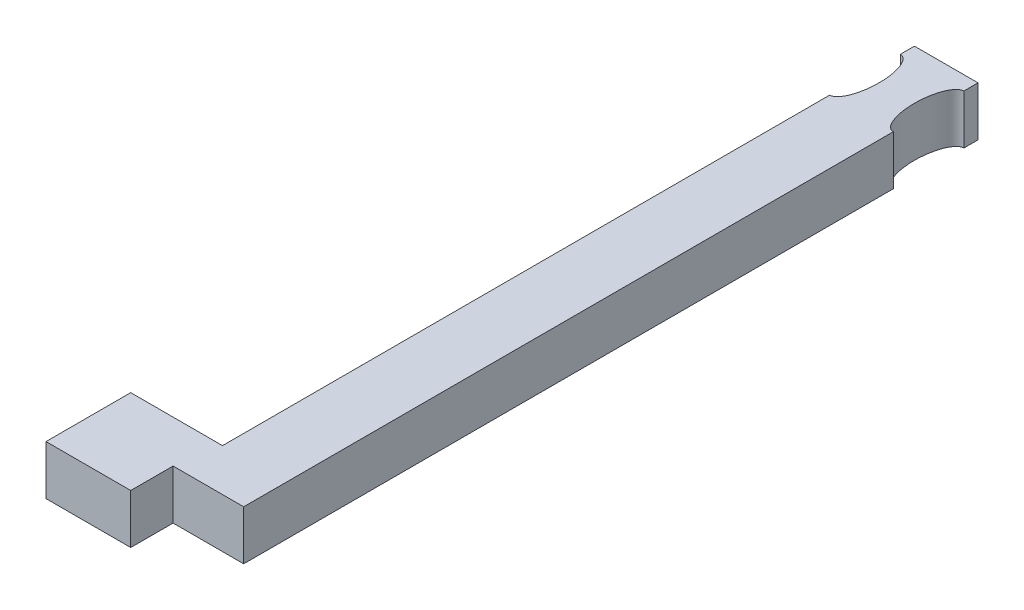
ISO-10303-21;
HEADER;
FILE_DESCRIPTION(('STEP AP214'),'2;1');
FILE_NAME('part.step','',(''),(''),'','','');
FILE_SCHEMA(('AUTOMOTIVE_DESIGN { 1 0 10303 214 1 1 1 1 }'));
ENDSEC;
DATA;
#1=APPLICATION_CONTEXT('core data for automotive mechanical design processes');
#2=APPLICATION_PROTOCOL_DEFINITION('international standard','automotive_design',2000,#1);
#3=PRODUCT_CONTEXT('',#1,'mechanical');
#4=PRODUCT('Part','Part','',(#3));
#5=PRODUCT_RELATED_PRODUCT_CATEGORY('part','',(#4));
#6=PRODUCT_DEFINITION_FORMATION('','',#4);
#7=PRODUCT_DEFINITION_CONTEXT('part definition',#1,'design');
#8=PRODUCT_DEFINITION('design','',#6,#7);
#9=PRODUCT_DEFINITION_SHAPE('','',#8);
#10=(LENGTH_UNIT() NAMED_UNIT(*) SI_UNIT(.MILLI.,.METRE.));
#11=(NAMED_UNIT(*) PLANE_ANGLE_UNIT() SI_UNIT($,.RADIAN.));
#12=(NAMED_UNIT(*) SI_UNIT($,.STERADIAN.) SOLID_ANGLE_UNIT());
#13=UNCERTAINTY_MEASURE_WITH_UNIT(LENGTH_MEASURE(1.E-05),#10,'distance_accuracy_value','');
#14=(GEOMETRIC_REPRESENTATION_CONTEXT(3) GLOBAL_UNCERTAINTY_ASSIGNED_CONTEXT((#13)) GLOBAL_UNIT_ASSIGNED_CONTEXT((#10,
#11,#12)) REPRESENTATION_CONTEXT('',''));
#15=CARTESIAN_POINT('',(0.,0.,0.));
#16=DIRECTION('',(0.,0.,1.));
#17=DIRECTION('',(1.,0.,0.));
#18=AXIS2_PLACEMENT_3D('',#15,#16,#17);
#19=CARTESIAN_POINT('',(6.5,3.5,-55.));
#20=DIRECTION('',(1.,0.,0.));
#21=DIRECTION('',(0.,0.,-1.));
#22=AXIS2_PLACEMENT_3D('',#19,#20,#21);
#23=PLANE('',#22);
#24=DIRECTION('',(0.,0.,1.));
#25=VECTOR('',#24,1.);
#26=CARTESIAN_POINT('',(6.5,0.,-55.));
#27=LINE('',#26,#25);
#28=CARTESIAN_POINT('',(6.5,0.,-55.));
#29=VERTEX_POINT('',#28);
#30=CARTESIAN_POINT('',(6.5,0.,-54.));
#31=VERTEX_POINT('',#30);
#32=EDGE_CURVE('E167',#29,#31,#27,.T.);
#33=ORIENTED_EDGE('',*,*,#32,.T.);
#34=DIRECTION('',(0.,-1.,0.));
#35=VECTOR('',#34,1.);
#36=CARTESIAN_POINT('',(6.5,3.5,-54.));
#37=LINE('',#36,#35);
#38=CARTESIAN_POINT('',(6.5,3.5,-54.));
#39=VERTEX_POINT('',#38);
#40=EDGE_CURVE('E11',#39,#31,#37,.T.);
#41=ORIENTED_EDGE('',*,*,#40,.F.);
#42=DIRECTION('',(0.,0.,1.));
#43=VECTOR('',#42,1.);
#44=CARTESIAN_POINT('',(6.5,3.5,-55.));
#45=LINE('',#44,#43);
#46=CARTESIAN_POINT('',(6.5,3.5,-55.));
#47=VERTEX_POINT('',#46);
#48=EDGE_CURVE('E191',#47,#39,#45,.T.);
#49=ORIENTED_EDGE('',*,*,#48,.F.);
#50=DIRECTION('',(0.,-1.,0.));
#51=VECTOR('',#50,1.);
#52=CARTESIAN_POINT('',(6.5,3.5,-55.));
#53=LINE('',#52,#51);
#54=EDGE_CURVE('E162',#47,#29,#53,.T.);
#55=ORIENTED_EDGE('',*,*,#54,.T.);
#56=EDGE_LOOP('',(#33,#41,#49,#55));
#57=FACE_BOUND('',#56,.T.);
#58=ADVANCED_FACE('F34',(#57),#23,.F.);
#59=CARTESIAN_POINT('',(6.5,3.5,-51.5));
#60=DIRECTION('',(0.,-1.,0.));
#61=DIRECTION('',(0.,0.,-1.));
#62=AXIS2_PLACEMENT_3D('',#59,#60,#61);
#63=ELLIPSE('',#62,2.5,1.);
#64=DIRECTION('',(0.,-1.,0.));
#65=VECTOR('',#64,1.);
#66=SURFACE_OF_LINEAR_EXTRUSION('',#63,#65);
#67=CARTESIAN_POINT('',(6.5,0.,-51.5));
#68=DIRECTION('',(0.,-1.,0.));
#69=DIRECTION('',(0.,0.,-1.));
#70=AXIS2_PLACEMENT_3D('',#67,#68,#69);
#71=ELLIPSE('',#70,2.5,1.);
#72=CARTESIAN_POINT('',(6.5,0.,-49.));
#73=VERTEX_POINT('',#72);
#74=EDGE_CURVE('E170',#31,#73,#71,.T.);
#75=ORIENTED_EDGE('',*,*,#74,.T.);
#76=DIRECTION('',(0.,-1.,0.));
#77=VECTOR('',#76,1.);
#78=CARTESIAN_POINT('',(6.5,3.5,-49.));
#79=LINE('',#78,#77);
#80=CARTESIAN_POINT('',(6.5,3.5,-49.));
#81=VERTEX_POINT('',#80);
#82=EDGE_CURVE('E41',#81,#73,#79,.T.);
#83=ORIENTED_EDGE('',*,*,#82,.F.);
#84=EDGE_CURVE('E110',#39,#81,#63,.T.);
#85=ORIENTED_EDGE('',*,*,#84,.F.);
#86=ORIENTED_EDGE('',*,*,#40,.T.);
#87=EDGE_LOOP('',(#75,#83,#85,#86));
#88=FACE_BOUND('',#87,.T.);
#89=ADVANCED_FACE('F265',(#88),#66,.F.);
#90=CARTESIAN_POINT('',(6.5,3.5,-49.));
#91=DIRECTION('',(1.,0.,0.));
#92=DIRECTION('',(0.,0.,-1.));
#93=AXIS2_PLACEMENT_3D('',#90,#91,#92);
#94=PLANE('',#93);
#95=DIRECTION('',(0.,0.,1.));
#96=VECTOR('',#95,1.);
#97=CARTESIAN_POINT('',(6.5,0.,-49.));
#98=LINE('',#97,#96);
#99=CARTESIAN_POINT('',(6.5,0.,-6.));
#100=VERTEX_POINT('',#99);
#101=EDGE_CURVE('E173',#73,#100,#98,.T.);
#102=ORIENTED_EDGE('',*,*,#101,.T.);
#103=DIRECTION('',(0.,-1.,0.));
#104=VECTOR('',#103,1.);
#105=CARTESIAN_POINT('',(6.5,3.5,-6.));
#106=LINE('',#105,#104);
#107=CARTESIAN_POINT('',(6.5,3.5,-6.));
#108=VERTEX_POINT('',#107);
#109=EDGE_CURVE('E210',#108,#100,#106,.T.);
#110=ORIENTED_EDGE('',*,*,#109,.F.);
#111=DIRECTION('',(0.,0.,1.));
#112=VECTOR('',#111,1.);
#113=CARTESIAN_POINT('',(6.5,3.5,-49.));
#114=LINE('',#113,#112);
#115=EDGE_CURVE('E218',#81,#108,#114,.T.);
#116=ORIENTED_EDGE('',*,*,#115,.F.);
#117=ORIENTED_EDGE('',*,*,#82,.T.);
#118=EDGE_LOOP('',(#102,#110,#116,#117));
#119=FACE_BOUND('',#118,.T.);
#120=ADVANCED_FACE('F216',(#119),#94,.F.);
#121=CARTESIAN_POINT('',(0.,3.5,-6.));
#122=DIRECTION('',(0.,0.,1.));
#123=DIRECTION('',(1.,0.,0.));
#124=AXIS2_PLACEMENT_3D('',#121,#122,#123);
#125=PLANE('',#124);
#126=DIRECTION('',(-1.,0.,0.));
#127=VECTOR('',#126,1.);
#128=CARTESIAN_POINT('',(0.,0.,-6.));
#129=LINE('',#128,#127);
#130=CARTESIAN_POINT('',(0.,0.,-6.));
#131=VERTEX_POINT('',#130);
#132=EDGE_CURVE('E175',#100,#131,#129,.T.);
#133=ORIENTED_EDGE('',*,*,#132,.T.);
#134=DIRECTION('',(0.,-1.,0.));
#135=VECTOR('',#134,1.);
#136=CARTESIAN_POINT('',(0.,3.5,-6.));
#137=LINE('',#136,#135);
#138=CARTESIAN_POINT('',(0.,3.5,-6.));
#139=VERTEX_POINT('',#138);
#140=EDGE_CURVE('E207',#139,#131,#137,.T.);
#141=ORIENTED_EDGE('',*,*,#140,.F.);
#142=DIRECTION('',(-1.,0.,0.));
#143=VECTOR('',#142,1.);
#144=CARTESIAN_POINT('',(0.,3.5,-6.));
#145=LINE('',#144,#143);
#146=EDGE_CURVE('E236',#108,#139,#145,.T.);
#147=ORIENTED_EDGE('',*,*,#146,.F.);
#148=ORIENTED_EDGE('',*,*,#109,.T.);
#149=EDGE_LOOP('',(#133,#141,#147,#148));
#150=FACE_BOUND('',#149,.T.);
#151=ADVANCED_FACE('F227',(#150),#125,.F.);
#152=CARTESIAN_POINT('',(0.,3.5,0.));
#153=DIRECTION('',(1.,0.,0.));
#154=DIRECTION('',(0.,0.,-1.));
#155=AXIS2_PLACEMENT_3D('',#152,#153,#154);
#156=PLANE('',#155);
#157=DIRECTION('',(0.,0.,1.));
#158=VECTOR('',#157,1.);
#159=CARTESIAN_POINT('',(0.,0.,0.));
#160=LINE('',#159,#158);
#161=CARTESIAN_POINT('',(0.,0.,0.));
#162=VERTEX_POINT('',#161);
#163=EDGE_CURVE('E177',#131,#162,#160,.T.);
#164=ORIENTED_EDGE('',*,*,#163,.T.);
#165=DIRECTION('',(0.,-1.,0.));
#166=VECTOR('',#165,1.);
#167=CARTESIAN_POINT('',(0.,3.5,0.));
#168=LINE('',#167,#166);
#169=CARTESIAN_POINT('',(0.,3.5,0.));
#170=VERTEX_POINT('',#169);
#171=EDGE_CURVE('E204',#170,#162,#168,.T.);
#172=ORIENTED_EDGE('',*,*,#171,.F.);
#173=DIRECTION('',(0.,0.,1.));
#174=VECTOR('',#173,1.);
#175=CARTESIAN_POINT('',(0.,3.5,0.));
#176=LINE('',#175,#174);
#177=EDGE_CURVE('E233',#139,#170,#176,.T.);
#178=ORIENTED_EDGE('',*,*,#177,.F.);
#179=ORIENTED_EDGE('',*,*,#140,.T.);
#180=EDGE_LOOP('',(#164,#172,#178,#179));
#181=FACE_BOUND('',#180,.T.);
#182=ADVANCED_FACE('F231',(#181),#156,.F.);
#183=CARTESIAN_POINT('',(0.,3.5,0.));
#184=DIRECTION('',(0.,0.,-1.));
#185=DIRECTION('',(-1.,0.,0.));
#186=AXIS2_PLACEMENT_3D('',#183,#184,#185);
#187=PLANE('',#186);
#188=DIRECTION('',(1.,0.,0.));
#189=VECTOR('',#188,1.);
#190=CARTESIAN_POINT('',(0.,0.,0.));
#191=LINE('',#190,#189);
#192=CARTESIAN_POINT('',(6.,0.,0.));
#193=VERTEX_POINT('',#192);
#194=EDGE_CURVE('E179',#162,#193,#191,.T.);
#195=ORIENTED_EDGE('',*,*,#194,.T.);
#196=DIRECTION('',(0.,-1.,0.));
#197=VECTOR('',#196,1.);
#198=CARTESIAN_POINT('',(6.,3.5,0.));
#199=LINE('',#198,#197);
#200=CARTESIAN_POINT('',(6.,3.5,0.));
#201=VERTEX_POINT('',#200);
#202=EDGE_CURVE('E201',#201,#193,#199,.T.);
#203=ORIENTED_EDGE('',*,*,#202,.F.);
#204=DIRECTION('',(1.,0.,0.));
#205=VECTOR('',#204,1.);
#206=CARTESIAN_POINT('',(0.,3.5,0.));
#207=LINE('',#206,#205);
#208=EDGE_CURVE('E235',#170,#201,#207,.T.);
#209=ORIENTED_EDGE('',*,*,#208,.F.);
#210=ORIENTED_EDGE('',*,*,#171,.T.);
#211=EDGE_LOOP('',(#195,#203,#209,#210));
#212=FACE_BOUND('',#211,.T.);
#213=ADVANCED_FACE('F274',(#212),#187,.F.);
#214=CARTESIAN_POINT('',(6.,3.5,0.));
#215=DIRECTION('',(-1.,0.,0.));
#216=DIRECTION('',(0.,0.,1.));
#217=AXIS2_PLACEMENT_3D('',#214,#215,#216);
#218=PLANE('',#217);
#219=DIRECTION('',(0.,0.,-1.));
#220=VECTOR('',#219,1.);
#221=CARTESIAN_POINT('',(6.,0.,0.));
#222=LINE('',#221,#220);
#223=CARTESIAN_POINT('',(6.,0.,-3.));
#224=VERTEX_POINT('',#223);
#225=EDGE_CURVE('E181',#193,#224,#222,.T.);
#226=ORIENTED_EDGE('',*,*,#225,.T.);
#227=DIRECTION('',(0.,-1.,0.));
#228=VECTOR('',#227,1.);
#229=CARTESIAN_POINT('',(6.,3.5,-3.));
#230=LINE('',#229,#228);
#231=CARTESIAN_POINT('',(6.,3.5,-3.));
#232=VERTEX_POINT('',#231);
#233=EDGE_CURVE('E198',#232,#224,#230,.T.);
#234=ORIENTED_EDGE('',*,*,#233,.F.);
#235=DIRECTION('',(0.,0.,-1.));
#236=VECTOR('',#235,1.);
#237=CARTESIAN_POINT('',(6.,3.5,0.));
#238=LINE('',#237,#236);
#239=EDGE_CURVE('E238',#201,#232,#238,.T.);
#240=ORIENTED_EDGE('',*,*,#239,.F.);
#241=ORIENTED_EDGE('',*,*,#202,.T.);
#242=EDGE_LOOP('',(#226,#234,#240,#241));
#243=FACE_BOUND('',#242,.T.);
#244=ADVANCED_FACE('F277',(#243),#218,.F.);
#245=CARTESIAN_POINT('',(6.,3.5,-3.));
#246=DIRECTION('',(0.,0.,-1.));
#247=DIRECTION('',(-1.,0.,0.));
#248=AXIS2_PLACEMENT_3D('',#245,#246,#247);
#249=PLANE('',#248);
#250=DIRECTION('',(1.,0.,0.));
#251=VECTOR('',#250,1.);
#252=CARTESIAN_POINT('',(6.,0.,-3.));
#253=LINE('',#252,#251);
#254=CARTESIAN_POINT('',(11.,0.,-3.));
#255=VERTEX_POINT('',#254);
#256=EDGE_CURVE('E183',#224,#255,#253,.T.);
#257=ORIENTED_EDGE('',*,*,#256,.T.);
#258=DIRECTION('',(0.,-1.,0.));
#259=VECTOR('',#258,1.);
#260=CARTESIAN_POINT('',(11.,3.5,-3.));
#261=LINE('',#260,#259);
#262=CARTESIAN_POINT('',(11.,3.5,-3.));
#263=VERTEX_POINT('',#262);
#264=EDGE_CURVE('E195',#263,#255,#261,.T.);
#265=ORIENTED_EDGE('',*,*,#264,.F.);
#266=DIRECTION('',(1.,0.,0.));
#267=VECTOR('',#266,1.);
#268=CARTESIAN_POINT('',(6.,3.5,-3.));
#269=LINE('',#268,#267);
#270=EDGE_CURVE('E244',#232,#263,#269,.T.);
#271=ORIENTED_EDGE('',*,*,#270,.F.);
#272=ORIENTED_EDGE('',*,*,#233,.T.);
#273=EDGE_LOOP('',(#257,#265,#271,#272));
#274=FACE_BOUND('',#273,.T.);
#275=ADVANCED_FACE('F250',(#274),#249,.F.);
#276=CARTESIAN_POINT('',(11.,3.5,-49.));
#277=DIRECTION('',(-1.,0.,0.));
#278=DIRECTION('',(0.,0.,1.));
#279=AXIS2_PLACEMENT_3D('',#276,#277,#278);
#280=PLANE('',#279);
#281=DIRECTION('',(0.,0.,-1.));
#282=VECTOR('',#281,1.);
#283=CARTESIAN_POINT('',(11.,0.,-49.));
#284=LINE('',#283,#282);
#285=CARTESIAN_POINT('',(11.,0.,-49.));
#286=VERTEX_POINT('',#285);
#287=EDGE_CURVE('E185',#255,#286,#284,.T.);
#288=ORIENTED_EDGE('',*,*,#287,.T.);
#289=DIRECTION('',(0.,-1.,0.));
#290=VECTOR('',#289,1.);
#291=CARTESIAN_POINT('',(11.,3.5,-49.));
#292=LINE('',#291,#290);
#293=CARTESIAN_POINT('',(11.,3.5,-49.));
#294=VERTEX_POINT('',#293);
#295=EDGE_CURVE('E157',#294,#286,#292,.T.);
#296=ORIENTED_EDGE('',*,*,#295,.F.);
#297=DIRECTION('',(0.,0.,-1.));
#298=VECTOR('',#297,1.);
#299=CARTESIAN_POINT('',(11.,3.5,-49.));
#300=LINE('',#299,#298);
#301=EDGE_CURVE('E145',#263,#294,#300,.T.);
#302=ORIENTED_EDGE('',*,*,#301,.F.);
#303=ORIENTED_EDGE('',*,*,#264,.T.);
#304=EDGE_LOOP('',(#288,#296,#302,#303));
#305=FACE_BOUND('',#304,.T.);
#306=ADVANCED_FACE('F254',(#305),#280,.F.);
#307=CARTESIAN_POINT('',(11.,3.5,-51.5));
#308=DIRECTION('',(0.,-1.,0.));
#309=DIRECTION('',(0.,0.,-1.));
#310=AXIS2_PLACEMENT_3D('',#307,#308,#309);
#311=ELLIPSE('',#310,2.5,1.);
#312=DIRECTION('',(0.,-1.,0.));
#313=VECTOR('',#312,1.);
#314=SURFACE_OF_LINEAR_EXTRUSION('',#311,#313);
#315=CARTESIAN_POINT('',(11.,0.,-51.5));
#316=DIRECTION('',(0.,-1.,0.));
#317=DIRECTION('',(0.,0.,-1.));
#318=AXIS2_PLACEMENT_3D('',#315,#316,#317);
#319=ELLIPSE('',#318,2.5,1.);
#320=CARTESIAN_POINT('',(11.,0.,-54.));
#321=VERTEX_POINT('',#320);
#322=EDGE_CURVE('E154',#286,#321,#319,.T.);
#323=ORIENTED_EDGE('',*,*,#322,.T.);
#324=DIRECTION('',(0.,-1.,0.));
#325=VECTOR('',#324,1.);
#326=CARTESIAN_POINT('',(11.,3.5,-54.));
#327=LINE('',#326,#325);
#328=CARTESIAN_POINT('',(11.,3.5,-54.));
#329=VERTEX_POINT('',#328);
#330=EDGE_CURVE('E151',#329,#321,#327,.T.);
#331=ORIENTED_EDGE('',*,*,#330,.F.);
#332=EDGE_CURVE('E138',#294,#329,#311,.T.);
#333=ORIENTED_EDGE('',*,*,#332,.F.);
#334=ORIENTED_EDGE('',*,*,#295,.T.);
#335=EDGE_LOOP('',(#323,#331,#333,#334));
#336=FACE_BOUND('',#335,.T.);
#337=ADVANCED_FACE('F152',(#336),#314,.F.);
#338=CARTESIAN_POINT('',(11.,3.5,-55.));
#339=DIRECTION('',(-1.,0.,0.));
#340=DIRECTION('',(0.,0.,1.));
#341=AXIS2_PLACEMENT_3D('',#338,#339,#340);
#342=PLANE('',#341);
#343=DIRECTION('',(0.,0.,-1.));
#344=VECTOR('',#343,1.);
#345=CARTESIAN_POINT('',(11.,0.,-55.));
#346=LINE('',#345,#344);
#347=CARTESIAN_POINT('',(11.,0.,-55.));
#348=VERTEX_POINT('',#347);
#349=EDGE_CURVE('E188',#321,#348,#346,.T.);
#350=ORIENTED_EDGE('',*,*,#349,.T.);
#351=DIRECTION('',(0.,-1.,0.));
#352=VECTOR('',#351,1.);
#353=CARTESIAN_POINT('',(11.,3.5,-55.));
#354=LINE('',#353,#352);
#355=CARTESIAN_POINT('',(11.,3.5,-55.));
#356=VERTEX_POINT('',#355);
#357=EDGE_CURVE('E158',#356,#348,#354,.T.);
#358=ORIENTED_EDGE('',*,*,#357,.F.);
#359=DIRECTION('',(0.,0.,-1.));
#360=VECTOR('',#359,1.);
#361=CARTESIAN_POINT('',(11.,3.5,-55.));
#362=LINE('',#361,#360);
#363=EDGE_CURVE('E142',#329,#356,#362,.T.);
#364=ORIENTED_EDGE('',*,*,#363,.F.);
#365=ORIENTED_EDGE('',*,*,#330,.T.);
#366=EDGE_LOOP('',(#350,#358,#364,#365));
#367=FACE_BOUND('',#366,.T.);
#368=ADVANCED_FACE('F160',(#367),#342,.F.);
#369=CARTESIAN_POINT('',(6.5,3.5,-55.));
#370=DIRECTION('',(0.,0.,1.));
#371=DIRECTION('',(1.,0.,0.));
#372=AXIS2_PLACEMENT_3D('',#369,#370,#371);
#373=PLANE('',#372);
#374=DIRECTION('',(-1.,0.,0.));
#375=VECTOR('',#374,1.);
#376=CARTESIAN_POINT('',(6.5,0.,-55.));
#377=LINE('',#376,#375);
#378=EDGE_CURVE('E102',#348,#29,#377,.T.);
#379=ORIENTED_EDGE('',*,*,#378,.T.);
#380=ORIENTED_EDGE('',*,*,#54,.F.);
#381=DIRECTION('',(-1.,0.,0.));
#382=VECTOR('',#381,1.);
#383=CARTESIAN_POINT('',(6.5,3.5,-55.));
#384=LINE('',#383,#382);
#385=EDGE_CURVE('E57',#356,#47,#384,.T.);
#386=ORIENTED_EDGE('',*,*,#385,.F.);
#387=ORIENTED_EDGE('',*,*,#357,.T.);
#388=EDGE_LOOP('',(#379,#380,#386,#387));
#389=FACE_BOUND('',#388,.T.);
#390=ADVANCED_FACE('F255',(#389),#373,.F.);
#391=CARTESIAN_POINT('',(6.5,3.5,-51.5));
#392=DIRECTION('',(0.,-1.,0.));
#393=DIRECTION('',(0.,0.,-1.));
#394=AXIS2_PLACEMENT_3D('',#391,#392,#393);
#395=PLANE('',#394);
#396=ORIENTED_EDGE('',*,*,#48,.T.);
#397=ORIENTED_EDGE('',*,*,#84,.T.);
#398=ORIENTED_EDGE('',*,*,#115,.T.);
#399=ORIENTED_EDGE('',*,*,#146,.T.);
#400=ORIENTED_EDGE('',*,*,#177,.T.);
#401=ORIENTED_EDGE('',*,*,#208,.T.);
#402=ORIENTED_EDGE('',*,*,#239,.T.);
#403=ORIENTED_EDGE('',*,*,#270,.T.);
#404=ORIENTED_EDGE('',*,*,#301,.T.);
#405=ORIENTED_EDGE('',*,*,#332,.T.);
#406=ORIENTED_EDGE('',*,*,#363,.T.);
#407=ORIENTED_EDGE('',*,*,#385,.T.);
#408=EDGE_LOOP('',(#396,#397,#398,#399,#400,#401,#402,#403,#404,#405,#406,#407));
#409=FACE_BOUND('',#408,.T.);
#410=ADVANCED_FACE('F140',(#409),#395,.F.);
#411=CARTESIAN_POINT('',(6.5,0.,-51.5));
#412=DIRECTION('',(0.,-1.,0.));
#413=DIRECTION('',(0.,0.,-1.));
#414=AXIS2_PLACEMENT_3D('',#411,#412,#413);
#415=PLANE('',#414);
#416=DIRECTION('',(0.,0.,1.));
#417=VECTOR('',#416,1.);
#418=CARTESIAN_POINT('',(4.7,0.,-1.3));
#419=LINE('',#418,#417);
#420=CARTESIAN_POINT('',(4.7,0.,-4.7));
#421=VERTEX_POINT('',#420);
#422=CARTESIAN_POINT('',(4.7,0.,-1.3));
#423=VERTEX_POINT('',#422);
#424=EDGE_CURVE('E48',#421,#423,#419,.T.);
#425=ORIENTED_EDGE('',*,*,#424,.F.);
#426=DIRECTION('',(1.,0.,0.));
#427=VECTOR('',#426,1.);
#428=CARTESIAN_POINT('',(1.3,0.,-4.7));
#429=LINE('',#428,#427);
#430=CARTESIAN_POINT('',(1.3,0.,-4.7));
#431=VERTEX_POINT('',#430);
#432=EDGE_CURVE('E443',#431,#421,#429,.T.);
#433=ORIENTED_EDGE('',*,*,#432,.F.);
#434=DIRECTION('',(0.,0.,-1.));
#435=VECTOR('',#434,1.);
#436=CARTESIAN_POINT('',(1.3,0.,-1.3));
#437=LINE('',#436,#435);
#438=CARTESIAN_POINT('',(1.3,0.,-1.3));
#439=VERTEX_POINT('',#438);
#440=EDGE_CURVE('E448',#439,#431,#437,.T.);
#441=ORIENTED_EDGE('',*,*,#440,.F.);
#442=DIRECTION('',(-1.,0.,0.));
#443=VECTOR('',#442,1.);
#444=CARTESIAN_POINT('',(1.3,0.,-1.3));
#445=LINE('',#444,#443);
#446=EDGE_CURVE('E454',#423,#439,#445,.T.);
#447=ORIENTED_EDGE('',*,*,#446,.F.);
#448=EDGE_LOOP('',(#425,#433,#441,#447));
#449=FACE_BOUND('',#448,.T.);
#450=ORIENTED_EDGE('',*,*,#32,.F.);
#451=ORIENTED_EDGE('',*,*,#378,.F.);
#452=ORIENTED_EDGE('',*,*,#349,.F.);
#453=ORIENTED_EDGE('',*,*,#322,.F.);
#454=ORIENTED_EDGE('',*,*,#287,.F.);
#455=ORIENTED_EDGE('',*,*,#256,.F.);
#456=ORIENTED_EDGE('',*,*,#225,.F.);
#457=ORIENTED_EDGE('',*,*,#194,.F.);
#458=ORIENTED_EDGE('',*,*,#163,.F.);
#459=ORIENTED_EDGE('',*,*,#132,.F.);
#460=ORIENTED_EDGE('',*,*,#101,.F.);
#461=ORIENTED_EDGE('',*,*,#74,.F.);
#462=EDGE_LOOP('',(#450,#451,#452,#453,#454,#455,#456,#457,#458,#459,#460,#461));
#463=FACE_BOUND('',#462,.T.);
#464=ADVANCED_FACE('F222',(#449,#463),#415,.T.);
#465=CARTESIAN_POINT('',(4.7,2.5,-1.3));
#466=DIRECTION('',(1.,0.,0.));
#467=DIRECTION('',(0.,0.,-1.));
#468=AXIS2_PLACEMENT_3D('',#465,#466,#467);
#469=PLANE('',#468);
#470=ORIENTED_EDGE('',*,*,#424,.T.);
#471=DIRECTION('',(0.,-1.,0.));
#472=VECTOR('',#471,1.);
#473=CARTESIAN_POINT('',(4.7,2.5,-1.3));
#474=LINE('',#473,#472);
#475=CARTESIAN_POINT('',(4.7,2.5,-1.3));
#476=VERTEX_POINT('',#475);
#477=EDGE_CURVE('E262',#476,#423,#474,.T.);
#478=ORIENTED_EDGE('',*,*,#477,.F.);
#479=DIRECTION('',(0.,0.,1.));
#480=VECTOR('',#479,1.);
#481=CARTESIAN_POINT('',(4.7,2.5,-1.3));
#482=LINE('',#481,#480);
#483=CARTESIAN_POINT('',(4.7,2.5,-4.7));
#484=VERTEX_POINT('',#483);
#485=EDGE_CURVE('E435',#484,#476,#482,.T.);
#486=ORIENTED_EDGE('',*,*,#485,.F.);
#487=DIRECTION('',(0.,-1.,0.));
#488=VECTOR('',#487,1.);
#489=CARTESIAN_POINT('',(4.7,2.5,-4.7));
#490=LINE('',#489,#488);
#491=EDGE_CURVE('E171',#484,#421,#490,.T.);
#492=ORIENTED_EDGE('',*,*,#491,.T.);
#493=EDGE_LOOP('',(#470,#478,#486,#492));
#494=FACE_BOUND('',#493,.T.);
#495=ADVANCED_FACE('F294',(#494),#469,.F.);
#496=CARTESIAN_POINT('',(1.3,2.5,-4.7));
#497=DIRECTION('',(0.,0.,-1.));
#498=DIRECTION('',(-1.,0.,0.));
#499=AXIS2_PLACEMENT_3D('',#496,#497,#498);
#500=PLANE('',#499);
#501=ORIENTED_EDGE('',*,*,#432,.T.);
#502=ORIENTED_EDGE('',*,*,#491,.F.);
#503=DIRECTION('',(1.,0.,0.));
#504=VECTOR('',#503,1.);
#505=CARTESIAN_POINT('',(1.3,2.5,-4.7));
#506=LINE('',#505,#504);
#507=CARTESIAN_POINT('',(1.3,2.5,-4.7));
#508=VERTEX_POINT('',#507);
#509=EDGE_CURVE('E441',#508,#484,#506,.T.);
#510=ORIENTED_EDGE('',*,*,#509,.F.);
#511=DIRECTION('',(0.,-1.,0.));
#512=VECTOR('',#511,1.);
#513=CARTESIAN_POINT('',(1.3,2.5,-4.7));
#514=LINE('',#513,#512);
#515=EDGE_CURVE('E460',#508,#431,#514,.T.);
#516=ORIENTED_EDGE('',*,*,#515,.T.);
#517=EDGE_LOOP('',(#501,#502,#510,#516));
#518=FACE_BOUND('',#517,.T.);
#519=ADVANCED_FACE('F300',(#518),#500,.F.);
#520=CARTESIAN_POINT('',(1.3,2.5,-1.3));
#521=DIRECTION('',(-1.,0.,0.));
#522=DIRECTION('',(0.,0.,1.));
#523=AXIS2_PLACEMENT_3D('',#520,#521,#522);
#524=PLANE('',#523);
#525=ORIENTED_EDGE('',*,*,#440,.T.);
#526=ORIENTED_EDGE('',*,*,#515,.F.);
#527=DIRECTION('',(0.,0.,-1.));
#528=VECTOR('',#527,1.);
#529=CARTESIAN_POINT('',(1.3,2.5,-1.3));
#530=LINE('',#529,#528);
#531=CARTESIAN_POINT('',(1.3,2.5,-1.3));
#532=VERTEX_POINT('',#531);
#533=EDGE_CURVE('E445',#532,#508,#530,.T.);
#534=ORIENTED_EDGE('',*,*,#533,.F.);
#535=DIRECTION('',(0.,-1.,0.));
#536=VECTOR('',#535,1.);
#537=CARTESIAN_POINT('',(1.3,2.5,-1.3));
#538=LINE('',#537,#536);
#539=EDGE_CURVE('E462',#532,#439,#538,.T.);
#540=ORIENTED_EDGE('',*,*,#539,.T.);
#541=EDGE_LOOP('',(#525,#526,#534,#540));
#542=FACE_BOUND('',#541,.T.);
#543=ADVANCED_FACE('F305',(#542),#524,.F.);
#544=CARTESIAN_POINT('',(1.3,2.5,-1.3));
#545=DIRECTION('',(0.,0.,1.));
#546=DIRECTION('',(1.,0.,0.));
#547=AXIS2_PLACEMENT_3D('',#544,#545,#546);
#548=PLANE('',#547);
#549=ORIENTED_EDGE('',*,*,#446,.T.);
#550=ORIENTED_EDGE('',*,*,#539,.F.);
#551=DIRECTION('',(-1.,0.,0.));
#552=VECTOR('',#551,1.);
#553=CARTESIAN_POINT('',(1.3,2.5,-1.3));
#554=LINE('',#553,#552);
#555=EDGE_CURVE('E439',#476,#532,#554,.T.);
#556=ORIENTED_EDGE('',*,*,#555,.F.);
#557=ORIENTED_EDGE('',*,*,#477,.T.);
#558=EDGE_LOOP('',(#549,#550,#556,#557));
#559=FACE_BOUND('',#558,.T.);
#560=ADVANCED_FACE('F301',(#559),#548,.F.);
#561=CARTESIAN_POINT('',(0.,2.5,0.));
#562=DIRECTION('',(0.,-1.,0.));
#563=DIRECTION('',(0.,0.,-1.));
#564=AXIS2_PLACEMENT_3D('',#561,#562,#563);
#565=PLANE('',#564);
#566=ORIENTED_EDGE('',*,*,#485,.T.);
#567=ORIENTED_EDGE('',*,*,#555,.T.);
#568=ORIENTED_EDGE('',*,*,#533,.T.);
#569=ORIENTED_EDGE('',*,*,#509,.T.);
#570=EDGE_LOOP('',(#566,#567,#568,#569));
#571=FACE_BOUND('',#570,.T.);
#572=ADVANCED_FACE('F304',(#571),#565,.T.);
#573=CLOSED_SHELL('',(#58,#89,#120,#151,#182,#213,#244,#275,#306,#337,#368,#390,#410,#464,#495,
#519,#543,#560,#572));
#574=MANIFOLD_SOLID_BREP('B2',#573);
#575=ADVANCED_BREP_SHAPE_REPRESENTATION('',(#18,#574),#14);
#576=SHAPE_DEFINITION_REPRESENTATION(#9,#575);
ENDSEC;
END-ISO-10303-21;
